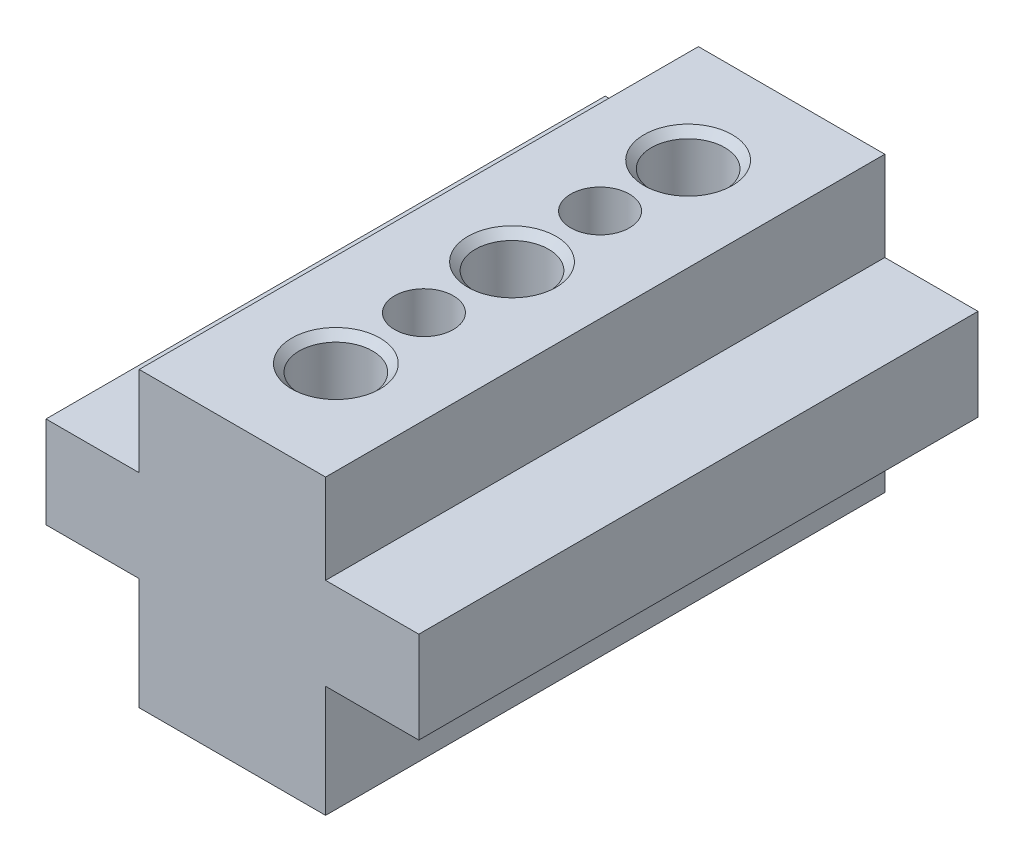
ISO-10303-21;
HEADER;
FILE_DESCRIPTION(('STEP AP214'),'2;1');
FILE_NAME('part.step','',(''),(''),'','','');
FILE_SCHEMA(('AUTOMOTIVE_DESIGN { 1 0 10303 214 1 1 1 1 }'));
ENDSEC;
DATA;
#1=APPLICATION_CONTEXT('core data for automotive mechanical design processes');
#2=APPLICATION_PROTOCOL_DEFINITION('international standard','automotive_design',2000,#1);
#3=PRODUCT_CONTEXT('',#1,'mechanical');
#4=PRODUCT('Part','Part','',(#3));
#5=PRODUCT_RELATED_PRODUCT_CATEGORY('part','',(#4));
#6=PRODUCT_DEFINITION_FORMATION('','',#4);
#7=PRODUCT_DEFINITION_CONTEXT('part definition',#1,'design');
#8=PRODUCT_DEFINITION('design','',#6,#7);
#9=PRODUCT_DEFINITION_SHAPE('','',#8);
#10=(LENGTH_UNIT() NAMED_UNIT(*) SI_UNIT(.MILLI.,.METRE.));
#11=(NAMED_UNIT(*) PLANE_ANGLE_UNIT() SI_UNIT($,.RADIAN.));
#12=(NAMED_UNIT(*) SI_UNIT($,.STERADIAN.) SOLID_ANGLE_UNIT());
#13=UNCERTAINTY_MEASURE_WITH_UNIT(LENGTH_MEASURE(1.E-05),#10,'distance_accuracy_value','');
#14=(GEOMETRIC_REPRESENTATION_CONTEXT(3) GLOBAL_UNCERTAINTY_ASSIGNED_CONTEXT((#13)) GLOBAL_UNIT_ASSIGNED_CONTEXT((#10,
#11,#12)) REPRESENTATION_CONTEXT('',''));
#15=CARTESIAN_POINT('',(0.,0.,0.));
#16=DIRECTION('',(0.,0.,1.));
#17=DIRECTION('',(1.,0.,0.));
#18=AXIS2_PLACEMENT_3D('',#15,#16,#17);
#19=CARTESIAN_POINT('',(-6.35,1.5621,9.525));
#20=DIRECTION('',(1.,0.,0.));
#21=DIRECTION('',(0.,0.,-1.));
#22=AXIS2_PLACEMENT_3D('',#19,#20,#21);
#23=PLANE('',#22);
#24=DIRECTION('',(0.,-1.,0.));
#25=VECTOR('',#24,1.);
#26=CARTESIAN_POINT('',(-6.35,1.5621,-9.525));
#27=LINE('',#26,#25);
#28=CARTESIAN_POINT('',(-6.35,1.5621,-9.525));
#29=VERTEX_POINT('',#28);
#30=CARTESIAN_POINT('',(-6.35,-1.5621,-9.525));
#31=VERTEX_POINT('',#30);
#32=EDGE_CURVE('E158',#29,#31,#27,.T.);
#33=ORIENTED_EDGE('',*,*,#32,.T.);
#34=DIRECTION('',(0.,0.,-1.));
#35=VECTOR('',#34,1.);
#36=CARTESIAN_POINT('',(-6.35,-1.5621,9.525));
#37=LINE('',#36,#35);
#38=CARTESIAN_POINT('',(-6.35,-1.5621,9.525));
#39=VERTEX_POINT('',#38);
#40=EDGE_CURVE('E206',#39,#31,#37,.T.);
#41=ORIENTED_EDGE('',*,*,#40,.F.);
#42=DIRECTION('',(0.,-1.,0.));
#43=VECTOR('',#42,1.);
#44=CARTESIAN_POINT('',(-6.35,1.5621,9.525));
#45=LINE('',#44,#43);
#46=CARTESIAN_POINT('',(-6.35,1.5621,9.525));
#47=VERTEX_POINT('',#46);
#48=EDGE_CURVE('E181',#47,#39,#45,.T.);
#49=ORIENTED_EDGE('',*,*,#48,.F.);
#50=DIRECTION('',(0.,0.,-1.));
#51=VECTOR('',#50,1.);
#52=CARTESIAN_POINT('',(-6.35,1.5621,9.525));
#53=LINE('',#52,#51);
#54=EDGE_CURVE('E154',#47,#29,#53,.T.);
#55=ORIENTED_EDGE('',*,*,#54,.T.);
#56=EDGE_LOOP('',(#33,#41,#49,#55));
#57=FACE_BOUND('',#56,.T.);
#58=ADVANCED_FACE('F33',(#57),#23,.F.);
#59=CARTESIAN_POINT('',(-6.35,-1.5621,9.525));
#60=DIRECTION('',(0.,1.,0.));
#61=DIRECTION('',(-1.,0.,0.));
#62=AXIS2_PLACEMENT_3D('',#59,#60,#61);
#63=PLANE('',#62);
#64=DIRECTION('',(1.,0.,0.));
#65=VECTOR('',#64,1.);
#66=CARTESIAN_POINT('',(-6.35,-1.5621,-9.525));
#67=LINE('',#66,#65);
#68=CARTESIAN_POINT('',(-3.175,-1.5621,-9.525));
#69=VERTEX_POINT('',#68);
#70=EDGE_CURVE('E161',#31,#69,#67,.T.);
#71=ORIENTED_EDGE('',*,*,#70,.T.);
#72=DIRECTION('',(0.,0.,-1.));
#73=VECTOR('',#72,1.);
#74=CARTESIAN_POINT('',(-3.175,-1.5621,9.525));
#75=LINE('',#74,#73);
#76=CARTESIAN_POINT('',(-3.175,-1.5621,9.525));
#77=VERTEX_POINT('',#76);
#78=EDGE_CURVE('E203',#77,#69,#75,.T.);
#79=ORIENTED_EDGE('',*,*,#78,.F.);
#80=DIRECTION('',(1.,0.,0.));
#81=VECTOR('',#80,1.);
#82=CARTESIAN_POINT('',(-6.35,-1.5621,9.525));
#83=LINE('',#82,#81);
#84=EDGE_CURVE('E107',#39,#77,#83,.T.);
#85=ORIENTED_EDGE('',*,*,#84,.F.);
#86=ORIENTED_EDGE('',*,*,#40,.T.);
#87=EDGE_LOOP('',(#71,#79,#85,#86));
#88=FACE_BOUND('',#87,.T.);
#89=ADVANCED_FACE('F239',(#88),#63,.F.);
#90=CARTESIAN_POINT('',(-3.175,-1.5621,9.525));
#91=DIRECTION('',(1.,0.,0.));
#92=DIRECTION('',(0.,1.,0.));
#93=AXIS2_PLACEMENT_3D('',#90,#91,#92);
#94=PLANE('',#93);
#95=DIRECTION('',(0.,-1.,0.));
#96=VECTOR('',#95,1.);
#97=CARTESIAN_POINT('',(-3.175,-1.5621,-9.525));
#98=LINE('',#97,#96);
#99=CARTESIAN_POINT('',(-3.175,-5.3721,-9.525));
#100=VERTEX_POINT('',#99);
#101=EDGE_CURVE('E164',#69,#100,#98,.T.);
#102=ORIENTED_EDGE('',*,*,#101,.T.);
#103=DIRECTION('',(0.,0.,-1.));
#104=VECTOR('',#103,1.);
#105=CARTESIAN_POINT('',(-3.175,-5.3721,9.525));
#106=LINE('',#105,#104);
#107=CARTESIAN_POINT('',(-3.175,-5.3721,9.525));
#108=VERTEX_POINT('',#107);
#109=EDGE_CURVE('E200',#108,#100,#106,.T.);
#110=ORIENTED_EDGE('',*,*,#109,.F.);
#111=DIRECTION('',(0.,-1.,0.));
#112=VECTOR('',#111,1.);
#113=CARTESIAN_POINT('',(-3.175,-1.5621,9.525));
#114=LINE('',#113,#112);
#115=EDGE_CURVE('E354',#77,#108,#114,.T.);
#116=ORIENTED_EDGE('',*,*,#115,.F.);
#117=ORIENTED_EDGE('',*,*,#78,.T.);
#118=EDGE_LOOP('',(#102,#110,#116,#117));
#119=FACE_BOUND('',#118,.T.);
#120=ADVANCED_FACE('F245',(#119),#94,.F.);
#121=CARTESIAN_POINT('',(-3.175,-5.3721,9.525));
#122=DIRECTION('',(0.,1.,0.));
#123=DIRECTION('',(0.,0.,1.));
#124=AXIS2_PLACEMENT_3D('',#121,#122,#123);
#125=PLANE('',#124);
#126=DIRECTION('',(1.,0.,0.));
#127=VECTOR('',#126,1.);
#128=CARTESIAN_POINT('',(-3.175,-5.3721,-9.525));
#129=LINE('',#128,#127);
#130=CARTESIAN_POINT('',(3.175,-5.3721,-9.525));
#131=VERTEX_POINT('',#130);
#132=EDGE_CURVE('E166',#100,#131,#129,.T.);
#133=ORIENTED_EDGE('',*,*,#132,.T.);
#134=DIRECTION('',(0.,0.,-1.));
#135=VECTOR('',#134,1.);
#136=CARTESIAN_POINT('',(3.175,-5.3721,9.525));
#137=LINE('',#136,#135);
#138=CARTESIAN_POINT('',(3.175,-5.3721,9.525));
#139=VERTEX_POINT('',#138);
#140=EDGE_CURVE('E197',#139,#131,#137,.T.);
#141=ORIENTED_EDGE('',*,*,#140,.F.);
#142=DIRECTION('',(1.,0.,0.));
#143=VECTOR('',#142,1.);
#144=CARTESIAN_POINT('',(-3.175,-5.3721,9.525));
#145=LINE('',#144,#143);
#146=EDGE_CURVE('E356',#108,#139,#145,.T.);
#147=ORIENTED_EDGE('',*,*,#146,.F.);
#148=ORIENTED_EDGE('',*,*,#109,.T.);
#149=EDGE_LOOP('',(#133,#141,#147,#148));
#150=FACE_BOUND('',#149,.T.);
#151=ADVANCED_FACE('F250',(#150),#125,.F.);
#152=CARTESIAN_POINT('',(3.175,-5.3721,9.525));
#153=DIRECTION('',(-1.,0.,0.));
#154=DIRECTION('',(0.,-1.,0.));
#155=AXIS2_PLACEMENT_3D('',#152,#153,#154);
#156=PLANE('',#155);
#157=DIRECTION('',(0.,1.,0.));
#158=VECTOR('',#157,1.);
#159=CARTESIAN_POINT('',(3.175,-5.3721,-9.525));
#160=LINE('',#159,#158);
#161=CARTESIAN_POINT('',(3.175,-1.5621,-9.525));
#162=VERTEX_POINT('',#161);
#163=EDGE_CURVE('E168',#131,#162,#160,.T.);
#164=ORIENTED_EDGE('',*,*,#163,.T.);
#165=DIRECTION('',(0.,0.,-1.));
#166=VECTOR('',#165,1.);
#167=CARTESIAN_POINT('',(3.175,-1.5621,9.525));
#168=LINE('',#167,#166);
#169=CARTESIAN_POINT('',(3.175,-1.5621,9.525));
#170=VERTEX_POINT('',#169);
#171=EDGE_CURVE('E194',#170,#162,#168,.T.);
#172=ORIENTED_EDGE('',*,*,#171,.F.);
#173=DIRECTION('',(0.,1.,0.));
#174=VECTOR('',#173,1.);
#175=CARTESIAN_POINT('',(3.175,-5.3721,9.525));
#176=LINE('',#175,#174);
#177=EDGE_CURVE('E358',#139,#170,#176,.T.);
#178=ORIENTED_EDGE('',*,*,#177,.F.);
#179=ORIENTED_EDGE('',*,*,#140,.T.);
#180=EDGE_LOOP('',(#164,#172,#178,#179));
#181=FACE_BOUND('',#180,.T.);
#182=ADVANCED_FACE('F254',(#181),#156,.F.);
#183=CARTESIAN_POINT('',(3.175,-1.5621,9.525));
#184=DIRECTION('',(0.,1.,0.));
#185=DIRECTION('',(-1.,0.,0.));
#186=AXIS2_PLACEMENT_3D('',#183,#184,#185);
#187=PLANE('',#186);
#188=DIRECTION('',(1.,0.,0.));
#189=VECTOR('',#188,1.);
#190=CARTESIAN_POINT('',(3.175,-1.5621,-9.525));
#191=LINE('',#190,#189);
#192=CARTESIAN_POINT('',(6.35,-1.5621,-9.525));
#193=VERTEX_POINT('',#192);
#194=EDGE_CURVE('E170',#162,#193,#191,.T.);
#195=ORIENTED_EDGE('',*,*,#194,.T.);
#196=DIRECTION('',(0.,0.,-1.));
#197=VECTOR('',#196,1.);
#198=CARTESIAN_POINT('',(6.35,-1.5621,9.525));
#199=LINE('',#198,#197);
#200=CARTESIAN_POINT('',(6.35,-1.5621,9.525));
#201=VERTEX_POINT('',#200);
#202=EDGE_CURVE('E191',#201,#193,#199,.T.);
#203=ORIENTED_EDGE('',*,*,#202,.F.);
#204=DIRECTION('',(1.,0.,0.));
#205=VECTOR('',#204,1.);
#206=CARTESIAN_POINT('',(3.175,-1.5621,9.525));
#207=LINE('',#206,#205);
#208=EDGE_CURVE('E360',#170,#201,#207,.T.);
#209=ORIENTED_EDGE('',*,*,#208,.F.);
#210=ORIENTED_EDGE('',*,*,#171,.T.);
#211=EDGE_LOOP('',(#195,#203,#209,#210));
#212=FACE_BOUND('',#211,.T.);
#213=ADVANCED_FACE('F258',(#212),#187,.F.);
#214=CARTESIAN_POINT('',(6.35,-1.5621,9.525));
#215=DIRECTION('',(-1.,0.,0.));
#216=DIRECTION('',(0.,0.,1.));
#217=AXIS2_PLACEMENT_3D('',#214,#215,#216);
#218=PLANE('',#217);
#219=DIRECTION('',(0.,1.,0.));
#220=VECTOR('',#219,1.);
#221=CARTESIAN_POINT('',(6.35,-1.5621,-9.525));
#222=LINE('',#221,#220);
#223=CARTESIAN_POINT('',(6.35,1.5621,-9.525));
#224=VERTEX_POINT('',#223);
#225=EDGE_CURVE('E172',#193,#224,#222,.T.);
#226=ORIENTED_EDGE('',*,*,#225,.T.);
#227=DIRECTION('',(0.,0.,-1.));
#228=VECTOR('',#227,1.);
#229=CARTESIAN_POINT('',(6.35,1.5621,9.525));
#230=LINE('',#229,#228);
#231=CARTESIAN_POINT('',(6.35,1.5621,9.525));
#232=VERTEX_POINT('',#231);
#233=EDGE_CURVE('E188',#232,#224,#230,.T.);
#234=ORIENTED_EDGE('',*,*,#233,.F.);
#235=DIRECTION('',(0.,1.,0.));
#236=VECTOR('',#235,1.);
#237=CARTESIAN_POINT('',(6.35,-1.5621,9.525));
#238=LINE('',#237,#236);
#239=EDGE_CURVE('E362',#201,#232,#238,.T.);
#240=ORIENTED_EDGE('',*,*,#239,.F.);
#241=ORIENTED_EDGE('',*,*,#202,.T.);
#242=EDGE_LOOP('',(#226,#234,#240,#241));
#243=FACE_BOUND('',#242,.T.);
#244=ADVANCED_FACE('F262',(#243),#218,.F.);
#245=CARTESIAN_POINT('',(6.35,1.5621,9.525));
#246=DIRECTION('',(0.,-1.,0.));
#247=DIRECTION('',(1.,0.,0.));
#248=AXIS2_PLACEMENT_3D('',#245,#246,#247);
#249=PLANE('',#248);
#250=DIRECTION('',(-1.,0.,0.));
#251=VECTOR('',#250,1.);
#252=CARTESIAN_POINT('',(6.35,1.5621,-9.525));
#253=LINE('',#252,#251);
#254=CARTESIAN_POINT('',(3.175,1.5621,-9.525));
#255=VERTEX_POINT('',#254);
#256=EDGE_CURVE('E174',#224,#255,#253,.T.);
#257=ORIENTED_EDGE('',*,*,#256,.T.);
#258=DIRECTION('',(0.,0.,-1.));
#259=VECTOR('',#258,1.);
#260=CARTESIAN_POINT('',(3.175,1.5621,9.525));
#261=LINE('',#260,#259);
#262=CARTESIAN_POINT('',(3.175,1.5621,9.525));
#263=VERTEX_POINT('',#262);
#264=EDGE_CURVE('E185',#263,#255,#261,.T.);
#265=ORIENTED_EDGE('',*,*,#264,.F.);
#266=DIRECTION('',(-1.,0.,0.));
#267=VECTOR('',#266,1.);
#268=CARTESIAN_POINT('',(6.35,1.5621,9.525));
#269=LINE('',#268,#267);
#270=EDGE_CURVE('E364',#232,#263,#269,.T.);
#271=ORIENTED_EDGE('',*,*,#270,.F.);
#272=ORIENTED_EDGE('',*,*,#233,.T.);
#273=EDGE_LOOP('',(#257,#265,#271,#272));
#274=FACE_BOUND('',#273,.T.);
#275=ADVANCED_FACE('F266',(#274),#249,.F.);
#276=CARTESIAN_POINT('',(3.175,1.5621,9.525));
#277=DIRECTION('',(-1.,0.,0.));
#278=DIRECTION('',(0.,-1.,0.));
#279=AXIS2_PLACEMENT_3D('',#276,#277,#278);
#280=PLANE('',#279);
#281=DIRECTION('',(0.,1.,0.));
#282=VECTOR('',#281,1.);
#283=CARTESIAN_POINT('',(3.175,1.5621,-9.525));
#284=LINE('',#283,#282);
#285=CARTESIAN_POINT('',(3.175,4.6101,-9.525));
#286=VERTEX_POINT('',#285);
#287=EDGE_CURVE('E176',#255,#286,#284,.T.);
#288=ORIENTED_EDGE('',*,*,#287,.T.);
#289=DIRECTION('',(0.,0.,-1.));
#290=VECTOR('',#289,1.);
#291=CARTESIAN_POINT('',(3.175,4.6101,9.525));
#292=LINE('',#291,#290);
#293=CARTESIAN_POINT('',(3.175,4.6101,9.525));
#294=VERTEX_POINT('',#293);
#295=EDGE_CURVE('E149',#294,#286,#292,.T.);
#296=ORIENTED_EDGE('',*,*,#295,.F.);
#297=DIRECTION('',(0.,1.,0.));
#298=VECTOR('',#297,1.);
#299=CARTESIAN_POINT('',(3.175,1.5621,9.525));
#300=LINE('',#299,#298);
#301=EDGE_CURVE('E140',#263,#294,#300,.T.);
#302=ORIENTED_EDGE('',*,*,#301,.F.);
#303=ORIENTED_EDGE('',*,*,#264,.T.);
#304=EDGE_LOOP('',(#288,#296,#302,#303));
#305=FACE_BOUND('',#304,.T.);
#306=ADVANCED_FACE('F270',(#305),#280,.F.);
#307=CARTESIAN_POINT('',(3.175,4.6101,9.525));
#308=DIRECTION('',(0.,-1.,0.));
#309=DIRECTION('',(0.,0.,-1.));
#310=AXIS2_PLACEMENT_3D('',#307,#308,#309);
#311=PLANE('',#310);
#312=CARTESIAN_POINT('',(0.,4.6101,-6.));
#313=DIRECTION('',(0.,-1.,0.));
#314=DIRECTION('',(0.,0.,-1.));
#315=AXIS2_PLACEMENT_3D('',#312,#313,#314);
#316=CIRCLE('',#315,1.50399999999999);
#317=CARTESIAN_POINT('',(0.,4.6101,-7.504));
#318=VERTEX_POINT('',#317);
#319=EDGE_CURVE('E217',#318,#318,#316,.T.);
#320=ORIENTED_EDGE('',*,*,#319,.T.);
#321=EDGE_LOOP('',(#320));
#322=FACE_BOUND('',#321,.T.);
#323=CARTESIAN_POINT('',(0.,4.6101,0.));
#324=DIRECTION('',(0.,-1.,0.));
#325=DIRECTION('',(0.,0.,-1.));
#326=AXIS2_PLACEMENT_3D('',#323,#324,#325);
#327=CIRCLE('',#326,1.50399999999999);
#328=CARTESIAN_POINT('',(0.,4.6101,-1.50399999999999));
#329=VERTEX_POINT('',#328);
#330=EDGE_CURVE('E214',#329,#329,#327,.T.);
#331=ORIENTED_EDGE('',*,*,#330,.T.);
#332=EDGE_LOOP('',(#331));
#333=FACE_BOUND('',#332,.T.);
#334=CARTESIAN_POINT('',(0.,4.6101,6.));
#335=DIRECTION('',(0.,-1.,0.));
#336=DIRECTION('',(0.,0.,-1.));
#337=AXIS2_PLACEMENT_3D('',#334,#335,#336);
#338=CIRCLE('',#337,1.50399999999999);
#339=CARTESIAN_POINT('',(0.,4.6101,4.496));
#340=VERTEX_POINT('',#339);
#341=EDGE_CURVE('E211',#340,#340,#338,.T.);
#342=ORIENTED_EDGE('',*,*,#341,.T.);
#343=EDGE_LOOP('',(#342));
#344=FACE_BOUND('',#343,.T.);
#345=CARTESIAN_POINT('',(0.,4.6101,-3.));
#346=DIRECTION('',(0.,1.,0.));
#347=DIRECTION('',(0.,0.,1.));
#348=AXIS2_PLACEMENT_3D('',#345,#346,#347);
#349=CIRCLE('',#348,1.00000000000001);
#350=CARTESIAN_POINT('',(0.,4.6101,-1.99999999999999));
#351=VERTEX_POINT('',#350);
#352=EDGE_CURVE('E333',#351,#351,#349,.T.);
#353=ORIENTED_EDGE('',*,*,#352,.F.);
#354=EDGE_LOOP('',(#353));
#355=FACE_BOUND('',#354,.T.);
#356=CARTESIAN_POINT('',(0.,4.6101,3.));
#357=DIRECTION('',(0.,1.,0.));
#358=DIRECTION('',(0.,0.,1.));
#359=AXIS2_PLACEMENT_3D('',#356,#357,#358);
#360=CIRCLE('',#359,1.00000000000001);
#361=CARTESIAN_POINT('',(0.,4.6101,4.00000000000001));
#362=VERTEX_POINT('',#361);
#363=EDGE_CURVE('E336',#362,#362,#360,.T.);
#364=ORIENTED_EDGE('',*,*,#363,.F.);
#365=EDGE_LOOP('',(#364));
#366=FACE_BOUND('',#365,.T.);
#367=DIRECTION('',(-1.,0.,0.));
#368=VECTOR('',#367,1.);
#369=CARTESIAN_POINT('',(3.175,4.6101,-9.525));
#370=LINE('',#369,#368);
#371=CARTESIAN_POINT('',(-3.175,4.6101,-9.525));
#372=VERTEX_POINT('',#371);
#373=EDGE_CURVE('E148',#286,#372,#370,.T.);
#374=ORIENTED_EDGE('',*,*,#373,.T.);
#375=DIRECTION('',(0.,0.,-1.));
#376=VECTOR('',#375,1.);
#377=CARTESIAN_POINT('',(-3.175,4.6101,9.525));
#378=LINE('',#377,#376);
#379=CARTESIAN_POINT('',(-3.175,4.6101,9.525));
#380=VERTEX_POINT('',#379);
#381=EDGE_CURVE('E145',#380,#372,#378,.T.);
#382=ORIENTED_EDGE('',*,*,#381,.F.);
#383=DIRECTION('',(-1.,0.,0.));
#384=VECTOR('',#383,1.);
#385=CARTESIAN_POINT('',(3.175,4.6101,9.525));
#386=LINE('',#385,#384);
#387=EDGE_CURVE('E134',#294,#380,#386,.T.);
#388=ORIENTED_EDGE('',*,*,#387,.F.);
#389=ORIENTED_EDGE('',*,*,#295,.T.);
#390=EDGE_LOOP('',(#374,#382,#388,#389));
#391=FACE_BOUND('',#390,.T.);
#392=ADVANCED_FACE('F146',(#322,#333,#344,#355,#366,#391),#311,.F.);
#393=CARTESIAN_POINT('',(-3.175,4.6101,9.525));
#394=DIRECTION('',(1.,0.,0.));
#395=DIRECTION('',(0.,1.,0.));
#396=AXIS2_PLACEMENT_3D('',#393,#394,#395);
#397=PLANE('',#396);
#398=DIRECTION('',(0.,-1.,0.));
#399=VECTOR('',#398,1.);
#400=CARTESIAN_POINT('',(-3.175,4.6101,-9.525));
#401=LINE('',#400,#399);
#402=CARTESIAN_POINT('',(-3.175,1.5621,-9.525));
#403=VERTEX_POINT('',#402);
#404=EDGE_CURVE('E92',#372,#403,#401,.T.);
#405=ORIENTED_EDGE('',*,*,#404,.T.);
#406=DIRECTION('',(0.,0.,-1.));
#407=VECTOR('',#406,1.);
#408=CARTESIAN_POINT('',(-3.175,1.5621,9.525));
#409=LINE('',#408,#407);
#410=CARTESIAN_POINT('',(-3.175,1.5621,9.525));
#411=VERTEX_POINT('',#410);
#412=EDGE_CURVE('E150',#411,#403,#409,.T.);
#413=ORIENTED_EDGE('',*,*,#412,.F.);
#414=DIRECTION('',(0.,-1.,0.));
#415=VECTOR('',#414,1.);
#416=CARTESIAN_POINT('',(-3.175,4.6101,9.525));
#417=LINE('',#416,#415);
#418=EDGE_CURVE('E138',#380,#411,#417,.T.);
#419=ORIENTED_EDGE('',*,*,#418,.F.);
#420=ORIENTED_EDGE('',*,*,#381,.T.);
#421=EDGE_LOOP('',(#405,#413,#419,#420));
#422=FACE_BOUND('',#421,.T.);
#423=ADVANCED_FACE('F152',(#422),#397,.F.);
#424=CARTESIAN_POINT('',(-3.175,1.5621,9.525));
#425=DIRECTION('',(0.,-1.,0.));
#426=DIRECTION('',(1.,0.,0.));
#427=AXIS2_PLACEMENT_3D('',#424,#425,#426);
#428=PLANE('',#427);
#429=DIRECTION('',(-1.,0.,0.));
#430=VECTOR('',#429,1.);
#431=CARTESIAN_POINT('',(-3.175,1.5621,-9.525));
#432=LINE('',#431,#430);
#433=EDGE_CURVE('E98',#403,#29,#432,.T.);
#434=ORIENTED_EDGE('',*,*,#433,.T.);
#435=ORIENTED_EDGE('',*,*,#54,.F.);
#436=DIRECTION('',(-1.,0.,0.));
#437=VECTOR('',#436,1.);
#438=CARTESIAN_POINT('',(-3.175,1.5621,9.525));
#439=LINE('',#438,#437);
#440=EDGE_CURVE('E50',#411,#47,#439,.T.);
#441=ORIENTED_EDGE('',*,*,#440,.F.);
#442=ORIENTED_EDGE('',*,*,#412,.T.);
#443=EDGE_LOOP('',(#434,#435,#441,#442));
#444=FACE_BOUND('',#443,.T.);
#445=ADVANCED_FACE('F280',(#444),#428,.F.);
#446=CARTESIAN_POINT('',(-6.35,-5.3721,9.525));
#447=DIRECTION('',(0.,0.,1.));
#448=DIRECTION('',(1.,0.,0.));
#449=AXIS2_PLACEMENT_3D('',#446,#447,#448);
#450=PLANE('',#449);
#451=ORIENTED_EDGE('',*,*,#48,.T.);
#452=ORIENTED_EDGE('',*,*,#84,.T.);
#453=ORIENTED_EDGE('',*,*,#115,.T.);
#454=ORIENTED_EDGE('',*,*,#146,.T.);
#455=ORIENTED_EDGE('',*,*,#177,.T.);
#456=ORIENTED_EDGE('',*,*,#208,.T.);
#457=ORIENTED_EDGE('',*,*,#239,.T.);
#458=ORIENTED_EDGE('',*,*,#270,.T.);
#459=ORIENTED_EDGE('',*,*,#301,.T.);
#460=ORIENTED_EDGE('',*,*,#387,.T.);
#461=ORIENTED_EDGE('',*,*,#418,.T.);
#462=ORIENTED_EDGE('',*,*,#440,.T.);
#463=EDGE_LOOP('',(#451,#452,#453,#454,#455,#456,#457,#458,#459,#460,#461,#462));
#464=FACE_BOUND('',#463,.T.);
#465=ADVANCED_FACE('F136',(#464),#450,.T.);
#466=CARTESIAN_POINT('',(-6.35,-5.3721,-9.525));
#467=DIRECTION('',(0.,0.,1.));
#468=DIRECTION('',(1.,0.,0.));
#469=AXIS2_PLACEMENT_3D('',#466,#467,#468);
#470=PLANE('',#469);
#471=ORIENTED_EDGE('',*,*,#32,.F.);
#472=ORIENTED_EDGE('',*,*,#433,.F.);
#473=ORIENTED_EDGE('',*,*,#404,.F.);
#474=ORIENTED_EDGE('',*,*,#373,.F.);
#475=ORIENTED_EDGE('',*,*,#287,.F.);
#476=ORIENTED_EDGE('',*,*,#256,.F.);
#477=ORIENTED_EDGE('',*,*,#225,.F.);
#478=ORIENTED_EDGE('',*,*,#194,.F.);
#479=ORIENTED_EDGE('',*,*,#163,.F.);
#480=ORIENTED_EDGE('',*,*,#132,.F.);
#481=ORIENTED_EDGE('',*,*,#101,.F.);
#482=ORIENTED_EDGE('',*,*,#70,.F.);
#483=EDGE_LOOP('',(#471,#472,#473,#474,#475,#476,#477,#478,#479,#480,#481,#482));
#484=FACE_BOUND('',#483,.T.);
#485=ADVANCED_FACE('F283',(#484),#470,.F.);
#486=CARTESIAN_POINT('',(0.,-1.89230000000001,6.));
#487=DIRECTION('',(0.,1.,0.));
#488=DIRECTION('',(0.,0.,1.));
#489=AXIS2_PLACEMENT_3D('',#486,#487,#488);
#490=CONICAL_SURFACE('',#489,1.24999999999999,1.02974425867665);
#491=CARTESIAN_POINT('',(0.,-2.64337577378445,6.));
#492=VERTEX_POINT('',#491);
#493=VERTEX_LOOP('',#492);
#494=FACE_BOUND('',#493,.T.);
#495=CARTESIAN_POINT('',(0.,-1.89230000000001,6.));
#496=DIRECTION('',(0.,1.,0.));
#497=DIRECTION('',(0.,0.,1.));
#498=AXIS2_PLACEMENT_3D('',#495,#496,#497);
#499=CIRCLE('',#498,1.24999999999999);
#500=CARTESIAN_POINT('',(0.,-1.89230000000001,7.24999999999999));
#501=VERTEX_POINT('',#500);
#502=EDGE_CURVE('E162',#501,#501,#499,.T.);
#503=ORIENTED_EDGE('',*,*,#502,.T.);
#504=EDGE_LOOP('',(#503));
#505=FACE_BOUND('',#504,.T.);
#506=ADVANCED_FACE('F286',(#494,#505),#490,.F.);
#507=CARTESIAN_POINT('',(0.,4.6101,6.));
#508=DIRECTION('',(0.,1.,0.));
#509=DIRECTION('',(0.,0.,1.));
#510=AXIS2_PLACEMENT_3D('',#507,#508,#509);
#511=CYLINDRICAL_SURFACE('',#510,1.24999999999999);
#512=CARTESIAN_POINT('',(0.,4.35609999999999,6.));
#513=DIRECTION('',(0.,-1.,0.));
#514=DIRECTION('',(0.,0.,-1.));
#515=AXIS2_PLACEMENT_3D('',#512,#513,#514);
#516=CIRCLE('',#515,1.24999999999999);
#517=CARTESIAN_POINT('',(0.,4.35609999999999,4.75000000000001));
#518=VERTEX_POINT('',#517);
#519=EDGE_CURVE('E11',#518,#518,#516,.F.);
#520=ORIENTED_EDGE('',*,*,#519,.T.);
#521=EDGE_LOOP('',(#520));
#522=FACE_BOUND('',#521,.T.);
#523=ORIENTED_EDGE('',*,*,#502,.F.);
#524=EDGE_LOOP('',(#523));
#525=FACE_BOUND('',#524,.T.);
#526=ADVANCED_FACE('F292',(#522,#525),#511,.F.);
#527=CARTESIAN_POINT('',(0.,-1.89230000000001,0.));
#528=DIRECTION('',(0.,1.,0.));
#529=DIRECTION('',(0.,0.,1.));
#530=AXIS2_PLACEMENT_3D('',#527,#528,#529);
#531=CONICAL_SURFACE('',#530,1.24999999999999,1.02974425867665);
#532=CARTESIAN_POINT('',(0.,-2.64337577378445,0.));
#533=VERTEX_POINT('',#532);
#534=VERTEX_LOOP('',#533);
#535=FACE_BOUND('',#534,.T.);
#536=CARTESIAN_POINT('',(0.,-1.89230000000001,0.));
#537=DIRECTION('',(0.,1.,0.));
#538=DIRECTION('',(0.,0.,1.));
#539=AXIS2_PLACEMENT_3D('',#536,#537,#538);
#540=CIRCLE('',#539,1.24999999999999);
#541=CARTESIAN_POINT('',(0.,-1.89230000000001,1.24999999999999));
#542=VERTEX_POINT('',#541);
#543=EDGE_CURVE('E347',#542,#542,#540,.T.);
#544=ORIENTED_EDGE('',*,*,#543,.T.);
#545=EDGE_LOOP('',(#544));
#546=FACE_BOUND('',#545,.T.);
#547=ADVANCED_FACE('F296',(#535,#546),#531,.F.);
#548=CARTESIAN_POINT('',(0.,4.6101,0.));
#549=DIRECTION('',(0.,1.,0.));
#550=DIRECTION('',(0.,0.,1.));
#551=AXIS2_PLACEMENT_3D('',#548,#549,#550);
#552=CYLINDRICAL_SURFACE('',#551,1.24999999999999);
#553=CARTESIAN_POINT('',(0.,4.35609999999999,0.));
#554=DIRECTION('',(0.,-1.,0.));
#555=DIRECTION('',(0.,0.,-1.));
#556=AXIS2_PLACEMENT_3D('',#553,#554,#555);
#557=CIRCLE('',#556,1.24999999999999);
#558=CARTESIAN_POINT('',(0.,4.35609999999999,-1.24999999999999));
#559=VERTEX_POINT('',#558);
#560=EDGE_CURVE('E42',#559,#559,#557,.F.);
#561=ORIENTED_EDGE('',*,*,#560,.T.);
#562=EDGE_LOOP('',(#561));
#563=FACE_BOUND('',#562,.T.);
#564=ORIENTED_EDGE('',*,*,#543,.F.);
#565=EDGE_LOOP('',(#564));
#566=FACE_BOUND('',#565,.T.);
#567=ADVANCED_FACE('F222',(#563,#566),#552,.F.);
#568=CARTESIAN_POINT('',(0.,-1.89230000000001,-6.));
#569=DIRECTION('',(0.,1.,0.));
#570=DIRECTION('',(0.,0.,1.));
#571=AXIS2_PLACEMENT_3D('',#568,#569,#570);
#572=CONICAL_SURFACE('',#571,1.24999999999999,1.02974425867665);
#573=CARTESIAN_POINT('',(0.,-2.64337577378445,-6.));
#574=VERTEX_POINT('',#573);
#575=VERTEX_LOOP('',#574);
#576=FACE_BOUND('',#575,.T.);
#577=CARTESIAN_POINT('',(0.,-1.89230000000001,-6.));
#578=DIRECTION('',(0.,1.,0.));
#579=DIRECTION('',(0.,0.,1.));
#580=AXIS2_PLACEMENT_3D('',#577,#578,#579);
#581=CIRCLE('',#580,1.24999999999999);
#582=CARTESIAN_POINT('',(0.,-1.89230000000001,-4.75000000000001));
#583=VERTEX_POINT('',#582);
#584=EDGE_CURVE('E344',#583,#583,#581,.T.);
#585=ORIENTED_EDGE('',*,*,#584,.T.);
#586=EDGE_LOOP('',(#585));
#587=FACE_BOUND('',#586,.T.);
#588=ADVANCED_FACE('F303',(#576,#587),#572,.F.);
#589=CARTESIAN_POINT('',(0.,4.6101,-6.));
#590=DIRECTION('',(0.,1.,0.));
#591=DIRECTION('',(0.,0.,1.));
#592=AXIS2_PLACEMENT_3D('',#589,#590,#591);
#593=CYLINDRICAL_SURFACE('',#592,1.24999999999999);
#594=CARTESIAN_POINT('',(0.,4.35609999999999,-6.));
#595=DIRECTION('',(0.,-1.,0.));
#596=DIRECTION('',(0.,0.,-1.));
#597=AXIS2_PLACEMENT_3D('',#594,#595,#596);
#598=CIRCLE('',#597,1.24999999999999);
#599=CARTESIAN_POINT('',(0.,4.35609999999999,-7.24999999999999));
#600=VERTEX_POINT('',#599);
#601=EDGE_CURVE('E208',#600,#600,#598,.F.);
#602=ORIENTED_EDGE('',*,*,#601,.T.);
#603=EDGE_LOOP('',(#602));
#604=FACE_BOUND('',#603,.T.);
#605=ORIENTED_EDGE('',*,*,#584,.F.);
#606=EDGE_LOOP('',(#605));
#607=FACE_BOUND('',#606,.T.);
#608=ADVANCED_FACE('F306',(#604,#607),#593,.F.);
#609=CARTESIAN_POINT('',(0.,0.610099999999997,3.));
#610=DIRECTION('',(0.,-1.,0.));
#611=DIRECTION('',(0.,0.,-1.));
#612=AXIS2_PLACEMENT_3D('',#609,#610,#611);
#613=PLANE('',#612);
#614=CARTESIAN_POINT('',(0.,0.610099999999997,3.));
#615=DIRECTION('',(0.,1.,0.));
#616=DIRECTION('',(0.,0.,1.));
#617=AXIS2_PLACEMENT_3D('',#614,#615,#616);
#618=CIRCLE('',#617,1.00000000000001);
#619=CARTESIAN_POINT('',(0.,0.610099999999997,4.00000000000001));
#620=VERTEX_POINT('',#619);
#621=EDGE_CURVE('E341',#620,#620,#618,.T.);
#622=ORIENTED_EDGE('',*,*,#621,.T.);
#623=EDGE_LOOP('',(#622));
#624=FACE_BOUND('',#623,.T.);
#625=ADVANCED_FACE('F310',(#624),#613,.F.);
#626=CARTESIAN_POINT('',(0.,4.6101,3.));
#627=DIRECTION('',(0.,1.,0.));
#628=DIRECTION('',(0.,0.,1.));
#629=AXIS2_PLACEMENT_3D('',#626,#627,#628);
#630=CYLINDRICAL_SURFACE('',#629,1.00000000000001);
#631=ORIENTED_EDGE('',*,*,#621,.F.);
#632=EDGE_LOOP('',(#631));
#633=FACE_BOUND('',#632,.T.);
#634=ORIENTED_EDGE('',*,*,#363,.T.);
#635=EDGE_LOOP('',(#634));
#636=FACE_BOUND('',#635,.T.);
#637=ADVANCED_FACE('F314',(#633,#636),#630,.F.);
#638=CARTESIAN_POINT('',(0.,0.610099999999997,-3.));
#639=DIRECTION('',(0.,-1.,0.));
#640=DIRECTION('',(0.,0.,-1.));
#641=AXIS2_PLACEMENT_3D('',#638,#639,#640);
#642=PLANE('',#641);
#643=CARTESIAN_POINT('',(0.,0.610099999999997,-3.));
#644=DIRECTION('',(0.,1.,0.));
#645=DIRECTION('',(0.,0.,1.));
#646=AXIS2_PLACEMENT_3D('',#643,#644,#645);
#647=CIRCLE('',#646,1.00000000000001);
#648=CARTESIAN_POINT('',(0.,0.610099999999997,-1.99999999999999));
#649=VERTEX_POINT('',#648);
#650=EDGE_CURVE('E330',#649,#649,#647,.T.);
#651=ORIENTED_EDGE('',*,*,#650,.T.);
#652=EDGE_LOOP('',(#651));
#653=FACE_BOUND('',#652,.T.);
#654=ADVANCED_FACE('F318',(#653),#642,.F.);
#655=CARTESIAN_POINT('',(0.,4.6101,-3.));
#656=DIRECTION('',(0.,1.,0.));
#657=DIRECTION('',(0.,0.,1.));
#658=AXIS2_PLACEMENT_3D('',#655,#656,#657);
#659=CYLINDRICAL_SURFACE('',#658,1.00000000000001);
#660=ORIENTED_EDGE('',*,*,#650,.F.);
#661=EDGE_LOOP('',(#660));
#662=FACE_BOUND('',#661,.T.);
#663=ORIENTED_EDGE('',*,*,#352,.T.);
#664=EDGE_LOOP('',(#663));
#665=FACE_BOUND('',#664,.T.);
#666=ADVANCED_FACE('F234',(#662,#665),#659,.F.);
#667=CARTESIAN_POINT('',(0.,4.35609999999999,-6.));
#668=DIRECTION('',(0.,1.,0.));
#669=DIRECTION('',(0.,0.,1.));
#670=AXIS2_PLACEMENT_3D('',#667,#668,#669);
#671=CONICAL_SURFACE('',#670,1.24999999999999,0.785398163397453);
#672=ORIENTED_EDGE('',*,*,#319,.F.);
#673=EDGE_LOOP('',(#672));
#674=FACE_BOUND('',#673,.T.);
#675=ORIENTED_EDGE('',*,*,#601,.F.);
#676=EDGE_LOOP('',(#675));
#677=FACE_BOUND('',#676,.T.);
#678=ADVANCED_FACE('F227',(#674,#677),#671,.F.);
#679=CARTESIAN_POINT('',(0.,4.35609999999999,0.));
#680=DIRECTION('',(0.,1.,0.));
#681=DIRECTION('',(0.,0.,1.));
#682=AXIS2_PLACEMENT_3D('',#679,#680,#681);
#683=CONICAL_SURFACE('',#682,1.24999999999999,0.785398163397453);
#684=ORIENTED_EDGE('',*,*,#330,.F.);
#685=EDGE_LOOP('',(#684));
#686=FACE_BOUND('',#685,.T.);
#687=ORIENTED_EDGE('',*,*,#560,.F.);
#688=EDGE_LOOP('',(#687));
#689=FACE_BOUND('',#688,.T.);
#690=ADVANCED_FACE('F225',(#686,#689),#683,.F.);
#691=CARTESIAN_POINT('',(0.,4.35609999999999,6.));
#692=DIRECTION('',(0.,1.,0.));
#693=DIRECTION('',(0.,0.,1.));
#694=AXIS2_PLACEMENT_3D('',#691,#692,#693);
#695=CONICAL_SURFACE('',#694,1.24999999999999,0.785398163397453);
#696=ORIENTED_EDGE('',*,*,#341,.F.);
#697=EDGE_LOOP('',(#696));
#698=FACE_BOUND('',#697,.T.);
#699=ORIENTED_EDGE('',*,*,#519,.F.);
#700=EDGE_LOOP('',(#699));
#701=FACE_BOUND('',#700,.T.);
#702=ADVANCED_FACE('F35',(#698,#701),#695,.F.);
#703=CLOSED_SHELL('',(#58,#89,#120,#151,#182,#213,#244,#275,#306,#392,#423,#445,#465,#485,#506,
#526,#547,#567,#588,#608,#625,#637,#654,#666,#678,#690,#702));
#704=MANIFOLD_SOLID_BREP('B2',#703);
#705=ADVANCED_BREP_SHAPE_REPRESENTATION('',(#18,#704),#14);
#706=SHAPE_DEFINITION_REPRESENTATION(#9,#705);
ENDSEC;
END-ISO-10303-21;
